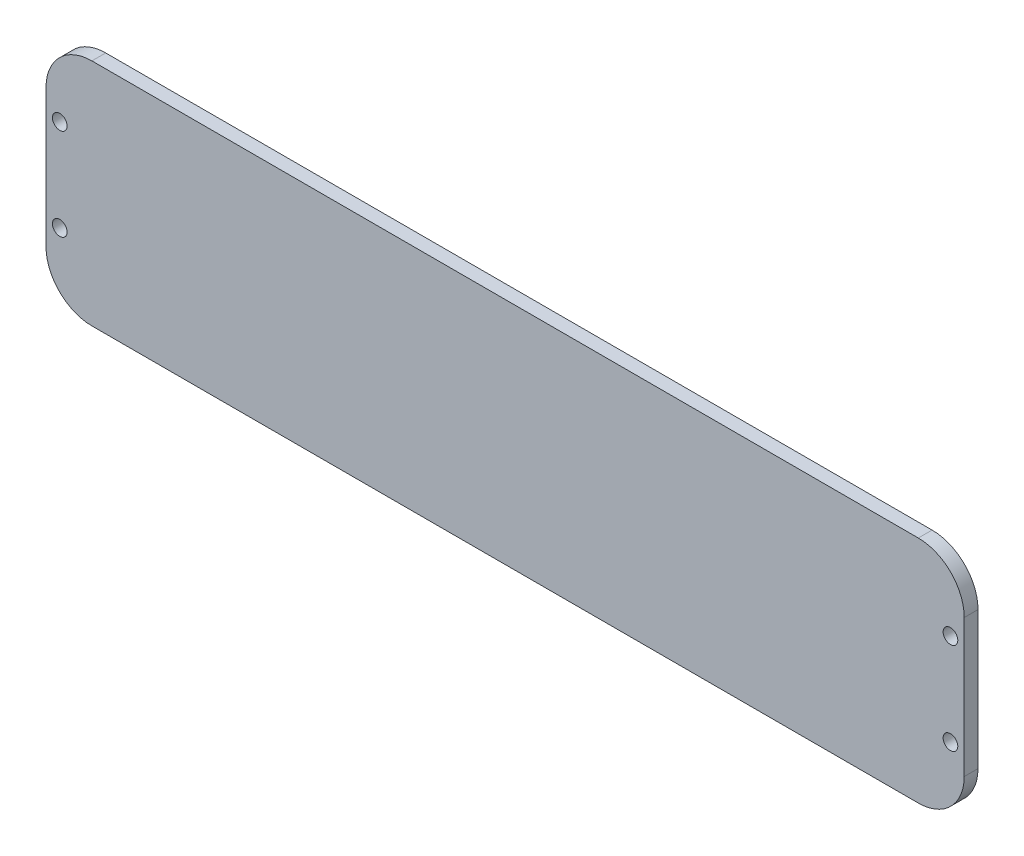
ISO-10303-21;
HEADER;
FILE_DESCRIPTION(('STEP AP214'),'2;1');
FILE_NAME('part.step','',(''),(''),'','','');
FILE_SCHEMA(('AUTOMOTIVE_DESIGN { 1 0 10303 214 1 1 1 1 }'));
ENDSEC;
DATA;
#1=APPLICATION_CONTEXT('core data for automotive mechanical design processes');
#2=APPLICATION_PROTOCOL_DEFINITION('international standard','automotive_design',2000,#1);
#3=PRODUCT_CONTEXT('',#1,'mechanical');
#4=PRODUCT('Part','Part','',(#3));
#5=PRODUCT_RELATED_PRODUCT_CATEGORY('part','',(#4));
#6=PRODUCT_DEFINITION_FORMATION('','',#4);
#7=PRODUCT_DEFINITION_CONTEXT('part definition',#1,'design');
#8=PRODUCT_DEFINITION('design','',#6,#7);
#9=PRODUCT_DEFINITION_SHAPE('','',#8);
#10=(LENGTH_UNIT() NAMED_UNIT(*) SI_UNIT(.MILLI.,.METRE.));
#11=(NAMED_UNIT(*) PLANE_ANGLE_UNIT() SI_UNIT($,.RADIAN.));
#12=(NAMED_UNIT(*) SI_UNIT($,.STERADIAN.) SOLID_ANGLE_UNIT());
#13=UNCERTAINTY_MEASURE_WITH_UNIT(LENGTH_MEASURE(1.E-05),#10,'distance_accuracy_value','');
#14=(GEOMETRIC_REPRESENTATION_CONTEXT(3) GLOBAL_UNCERTAINTY_ASSIGNED_CONTEXT((#13)) GLOBAL_UNIT_ASSIGNED_CONTEXT((#10,
#11,#12)) REPRESENTATION_CONTEXT('',''));
#15=CARTESIAN_POINT('',(0.,0.,0.));
#16=DIRECTION('',(0.,0.,1.));
#17=DIRECTION('',(1.,0.,0.));
#18=AXIS2_PLACEMENT_3D('',#15,#16,#17);
#19=CARTESIAN_POINT('',(0.,0.,3.));
#20=DIRECTION('',(0.,0.,-1.));
#21=DIRECTION('',(-1.,0.,0.));
#22=AXIS2_PLACEMENT_3D('',#19,#20,#21);
#23=PLANE('',#22);
#24=DIRECTION('',(1.,0.,0.));
#25=VECTOR('',#24,1.);
#26=CARTESIAN_POINT('',(-100.,-25.,3.));
#27=LINE('',#26,#25);
#28=CARTESIAN_POINT('',(-90.,-25.,3.));
#29=VERTEX_POINT('',#28);
#30=CARTESIAN_POINT('',(90.,-25.,3.));
#31=VERTEX_POINT('',#30);
#32=EDGE_CURVE('E148',#29,#31,#27,.T.);
#33=ORIENTED_EDGE('',*,*,#32,.T.);
#34=CARTESIAN_POINT('',(90.,-15.,3.));
#35=DIRECTION('',(0.,0.,-1.));
#36=DIRECTION('',(-1.,0.,0.));
#37=AXIS2_PLACEMENT_3D('',#34,#35,#36);
#38=CIRCLE('',#37,10.);
#39=CARTESIAN_POINT('',(100.,-15.,3.));
#40=VERTEX_POINT('',#39);
#41=EDGE_CURVE('E178',#31,#40,#38,.F.);
#42=ORIENTED_EDGE('',*,*,#41,.T.);
#43=DIRECTION('',(0.,1.,0.));
#44=VECTOR('',#43,1.);
#45=CARTESIAN_POINT('',(100.,-25.,3.));
#46=LINE('',#45,#44);
#47=CARTESIAN_POINT('',(100.,15.,3.));
#48=VERTEX_POINT('',#47);
#49=EDGE_CURVE('E126',#40,#48,#46,.T.);
#50=ORIENTED_EDGE('',*,*,#49,.T.);
#51=CARTESIAN_POINT('',(90.,15.,3.));
#52=DIRECTION('',(0.,0.,-1.));
#53=DIRECTION('',(-1.,0.,0.));
#54=AXIS2_PLACEMENT_3D('',#51,#52,#53);
#55=CIRCLE('',#54,10.);
#56=CARTESIAN_POINT('',(90.,25.,3.));
#57=VERTEX_POINT('',#56);
#58=EDGE_CURVE('E170',#48,#57,#55,.F.);
#59=ORIENTED_EDGE('',*,*,#58,.T.);
#60=DIRECTION('',(-1.,0.,0.));
#61=VECTOR('',#60,1.);
#62=CARTESIAN_POINT('',(-100.,25.,3.));
#63=LINE('',#62,#61);
#64=CARTESIAN_POINT('',(-90.,25.,3.));
#65=VERTEX_POINT('',#64);
#66=EDGE_CURVE('E192',#57,#65,#63,.T.);
#67=ORIENTED_EDGE('',*,*,#66,.T.);
#68=CARTESIAN_POINT('',(-90.,15.,3.));
#69=DIRECTION('',(0.,0.,-1.));
#70=DIRECTION('',(-1.,0.,0.));
#71=AXIS2_PLACEMENT_3D('',#68,#69,#70);
#72=CIRCLE('',#71,10.);
#73=CARTESIAN_POINT('',(-100.,15.,3.));
#74=VERTEX_POINT('',#73);
#75=EDGE_CURVE('E61',#65,#74,#72,.F.);
#76=ORIENTED_EDGE('',*,*,#75,.T.);
#77=DIRECTION('',(0.,-1.,0.));
#78=VECTOR('',#77,1.);
#79=CARTESIAN_POINT('',(-100.,-25.,3.));
#80=LINE('',#79,#78);
#81=CARTESIAN_POINT('',(-100.,-15.,3.));
#82=VERTEX_POINT('',#81);
#83=EDGE_CURVE('E200',#74,#82,#80,.T.);
#84=ORIENTED_EDGE('',*,*,#83,.T.);
#85=CARTESIAN_POINT('',(-90.,-15.,3.));
#86=DIRECTION('',(0.,0.,-1.));
#87=DIRECTION('',(-1.,0.,0.));
#88=AXIS2_PLACEMENT_3D('',#85,#86,#87);
#89=CIRCLE('',#88,10.);
#90=EDGE_CURVE('E175',#82,#29,#89,.F.);
#91=ORIENTED_EDGE('',*,*,#90,.T.);
#92=EDGE_LOOP('',(#33,#42,#50,#59,#67,#76,#84,#91));
#93=FACE_BOUND('',#92,.T.);
#94=CARTESIAN_POINT('',(-97.,10.,3.));
#95=DIRECTION('',(0.,0.,1.));
#96=DIRECTION('',(1.,0.,0.));
#97=AXIS2_PLACEMENT_3D('',#94,#95,#96);
#98=CIRCLE('',#97,1.6);
#99=CARTESIAN_POINT('',(-95.4,10.,3.));
#100=VERTEX_POINT('',#99);
#101=EDGE_CURVE('E136',#100,#100,#98,.T.);
#102=ORIENTED_EDGE('',*,*,#101,.F.);
#103=EDGE_LOOP('',(#102));
#104=FACE_BOUND('',#103,.T.);
#105=CARTESIAN_POINT('',(-97.,-10.,3.));
#106=DIRECTION('',(0.,0.,1.));
#107=DIRECTION('',(1.,0.,0.));
#108=AXIS2_PLACEMENT_3D('',#105,#106,#107);
#109=CIRCLE('',#108,1.6);
#110=CARTESIAN_POINT('',(-95.4,-10.,3.));
#111=VERTEX_POINT('',#110);
#112=EDGE_CURVE('E212',#111,#111,#109,.T.);
#113=ORIENTED_EDGE('',*,*,#112,.F.);
#114=EDGE_LOOP('',(#113));
#115=FACE_BOUND('',#114,.T.);
#116=CARTESIAN_POINT('',(97.,-10.,3.));
#117=DIRECTION('',(0.,0.,1.));
#118=DIRECTION('',(-1.,0.,0.));
#119=AXIS2_PLACEMENT_3D('',#116,#117,#118);
#120=CIRCLE('',#119,1.6);
#121=CARTESIAN_POINT('',(95.4,-10.,3.));
#122=VERTEX_POINT('',#121);
#123=EDGE_CURVE('E218',#122,#122,#120,.T.);
#124=ORIENTED_EDGE('',*,*,#123,.F.);
#125=EDGE_LOOP('',(#124));
#126=FACE_BOUND('',#125,.T.);
#127=CARTESIAN_POINT('',(97.,10.,3.));
#128=DIRECTION('',(0.,0.,1.));
#129=DIRECTION('',(-1.,0.,0.));
#130=AXIS2_PLACEMENT_3D('',#127,#128,#129);
#131=CIRCLE('',#130,1.6);
#132=CARTESIAN_POINT('',(95.4,10.,3.));
#133=VERTEX_POINT('',#132);
#134=EDGE_CURVE('E226',#133,#133,#131,.T.);
#135=ORIENTED_EDGE('',*,*,#134,.F.);
#136=EDGE_LOOP('',(#135));
#137=FACE_BOUND('',#136,.T.);
#138=ADVANCED_FACE('F38',(#93,#104,#115,#126,#137),#23,.F.);
#139=CARTESIAN_POINT('',(0.,0.,0.));
#140=DIRECTION('',(0.,0.,-1.));
#141=DIRECTION('',(-1.,0.,0.));
#142=AXIS2_PLACEMENT_3D('',#139,#140,#141);
#143=PLANE('',#142);
#144=CARTESIAN_POINT('',(97.,-10.,0.));
#145=DIRECTION('',(0.,0.,1.));
#146=DIRECTION('',(-1.,0.,0.));
#147=AXIS2_PLACEMENT_3D('',#144,#145,#146);
#148=CIRCLE('',#147,1.6);
#149=CARTESIAN_POINT('',(95.4,-10.,0.));
#150=VERTEX_POINT('',#149);
#151=EDGE_CURVE('E222',#150,#150,#148,.T.);
#152=ORIENTED_EDGE('',*,*,#151,.T.);
#153=EDGE_LOOP('',(#152));
#154=FACE_BOUND('',#153,.T.);
#155=CARTESIAN_POINT('',(-97.,10.,0.));
#156=DIRECTION('',(0.,0.,1.));
#157=DIRECTION('',(1.,0.,0.));
#158=AXIS2_PLACEMENT_3D('',#155,#156,#157);
#159=CIRCLE('',#158,1.6);
#160=CARTESIAN_POINT('',(-95.4,10.,0.));
#161=VERTEX_POINT('',#160);
#162=EDGE_CURVE('E145',#161,#161,#159,.T.);
#163=ORIENTED_EDGE('',*,*,#162,.T.);
#164=EDGE_LOOP('',(#163));
#165=FACE_BOUND('',#164,.T.);
#166=DIRECTION('',(0.,1.,0.));
#167=VECTOR('',#166,1.);
#168=CARTESIAN_POINT('',(100.,-25.,0.));
#169=LINE('',#168,#167);
#170=CARTESIAN_POINT('',(100.,-15.,0.));
#171=VERTEX_POINT('',#170);
#172=CARTESIAN_POINT('',(100.,15.,0.));
#173=VERTEX_POINT('',#172);
#174=EDGE_CURVE('E123',#171,#173,#169,.T.);
#175=ORIENTED_EDGE('',*,*,#174,.F.);
#176=CARTESIAN_POINT('',(90.,-15.,0.));
#177=DIRECTION('',(0.,0.,-1.));
#178=DIRECTION('',(-1.,0.,0.));
#179=AXIS2_PLACEMENT_3D('',#176,#177,#178);
#180=CIRCLE('',#179,10.);
#181=CARTESIAN_POINT('',(90.,-25.,0.));
#182=VERTEX_POINT('',#181);
#183=EDGE_CURVE('E105',#171,#182,#180,.T.);
#184=ORIENTED_EDGE('',*,*,#183,.T.);
#185=DIRECTION('',(1.,0.,0.));
#186=VECTOR('',#185,1.);
#187=CARTESIAN_POINT('',(-100.,-25.,0.));
#188=LINE('',#187,#186);
#189=CARTESIAN_POINT('',(-90.,-25.,0.));
#190=VERTEX_POINT('',#189);
#191=EDGE_CURVE('E153',#190,#182,#188,.T.);
#192=ORIENTED_EDGE('',*,*,#191,.F.);
#193=CARTESIAN_POINT('',(-90.,-15.,0.));
#194=DIRECTION('',(0.,0.,-1.));
#195=DIRECTION('',(-1.,0.,0.));
#196=AXIS2_PLACEMENT_3D('',#193,#194,#195);
#197=CIRCLE('',#196,10.);
#198=CARTESIAN_POINT('',(-100.,-15.,0.));
#199=VERTEX_POINT('',#198);
#200=EDGE_CURVE('E117',#190,#199,#197,.T.);
#201=ORIENTED_EDGE('',*,*,#200,.T.);
#202=DIRECTION('',(0.,-1.,0.));
#203=VECTOR('',#202,1.);
#204=CARTESIAN_POINT('',(-100.,-25.,0.));
#205=LINE('',#204,#203);
#206=CARTESIAN_POINT('',(-100.,15.,0.));
#207=VERTEX_POINT('',#206);
#208=EDGE_CURVE('E141',#207,#199,#205,.T.);
#209=ORIENTED_EDGE('',*,*,#208,.F.);
#210=CARTESIAN_POINT('',(-90.,15.,0.));
#211=DIRECTION('',(0.,0.,-1.));
#212=DIRECTION('',(-1.,0.,0.));
#213=AXIS2_PLACEMENT_3D('',#210,#211,#212);
#214=CIRCLE('',#213,10.);
#215=CARTESIAN_POINT('',(-90.,25.,0.));
#216=VERTEX_POINT('',#215);
#217=EDGE_CURVE('E160',#207,#216,#214,.T.);
#218=ORIENTED_EDGE('',*,*,#217,.T.);
#219=DIRECTION('',(-1.,0.,0.));
#220=VECTOR('',#219,1.);
#221=CARTESIAN_POINT('',(-100.,25.,0.));
#222=LINE('',#221,#220);
#223=CARTESIAN_POINT('',(90.,25.,0.));
#224=VERTEX_POINT('',#223);
#225=EDGE_CURVE('E135',#224,#216,#222,.T.);
#226=ORIENTED_EDGE('',*,*,#225,.F.);
#227=CARTESIAN_POINT('',(90.,15.,0.));
#228=DIRECTION('',(0.,0.,-1.));
#229=DIRECTION('',(-1.,0.,0.));
#230=AXIS2_PLACEMENT_3D('',#227,#228,#229);
#231=CIRCLE('',#230,10.);
#232=EDGE_CURVE('E128',#224,#173,#231,.T.);
#233=ORIENTED_EDGE('',*,*,#232,.T.);
#234=EDGE_LOOP('',(#175,#184,#192,#201,#209,#218,#226,#233));
#235=FACE_BOUND('',#234,.T.);
#236=CARTESIAN_POINT('',(-97.,-10.,0.));
#237=DIRECTION('',(0.,0.,1.));
#238=DIRECTION('',(1.,0.,0.));
#239=AXIS2_PLACEMENT_3D('',#236,#237,#238);
#240=CIRCLE('',#239,1.6);
#241=CARTESIAN_POINT('',(-95.4,-10.,0.));
#242=VERTEX_POINT('',#241);
#243=EDGE_CURVE('E214',#242,#242,#240,.T.);
#244=ORIENTED_EDGE('',*,*,#243,.T.);
#245=EDGE_LOOP('',(#244));
#246=FACE_BOUND('',#245,.T.);
#247=CARTESIAN_POINT('',(97.,10.,0.));
#248=DIRECTION('',(0.,0.,1.));
#249=DIRECTION('',(-1.,0.,0.));
#250=AXIS2_PLACEMENT_3D('',#247,#248,#249);
#251=CIRCLE('',#250,1.6);
#252=CARTESIAN_POINT('',(95.4,10.,0.));
#253=VERTEX_POINT('',#252);
#254=EDGE_CURVE('E230',#253,#253,#251,.T.);
#255=ORIENTED_EDGE('',*,*,#254,.T.);
#256=EDGE_LOOP('',(#255));
#257=FACE_BOUND('',#256,.T.);
#258=ADVANCED_FACE('F131',(#154,#165,#235,#246,#257),#143,.T.);
#259=CARTESIAN_POINT('',(100.,-25.,3.));
#260=DIRECTION('',(-1.,0.,0.));
#261=DIRECTION('',(0.,0.,1.));
#262=AXIS2_PLACEMENT_3D('',#259,#260,#261);
#263=PLANE('',#262);
#264=ORIENTED_EDGE('',*,*,#49,.F.);
#265=DIRECTION('',(0.,0.,-1.));
#266=VECTOR('',#265,1.);
#267=CARTESIAN_POINT('',(100.,-15.,3.));
#268=LINE('',#267,#266);
#269=EDGE_CURVE('E109',#40,#171,#268,.T.);
#270=ORIENTED_EDGE('',*,*,#269,.T.);
#271=ORIENTED_EDGE('',*,*,#174,.T.);
#272=DIRECTION('',(0.,0.,-1.));
#273=VECTOR('',#272,1.);
#274=CARTESIAN_POINT('',(100.,15.,3.));
#275=LINE('',#274,#273);
#276=EDGE_CURVE('E129',#173,#48,#275,.F.);
#277=ORIENTED_EDGE('',*,*,#276,.T.);
#278=EDGE_LOOP('',(#264,#270,#271,#277));
#279=FACE_BOUND('',#278,.T.);
#280=ADVANCED_FACE('F122',(#279),#263,.F.);
#281=CARTESIAN_POINT('',(-100.,25.,3.));
#282=DIRECTION('',(0.,-1.,0.));
#283=DIRECTION('',(0.,0.,-1.));
#284=AXIS2_PLACEMENT_3D('',#281,#282,#283);
#285=PLANE('',#284);
#286=ORIENTED_EDGE('',*,*,#225,.T.);
#287=DIRECTION('',(0.,0.,-1.));
#288=VECTOR('',#287,1.);
#289=CARTESIAN_POINT('',(-90.,25.,3.));
#290=LINE('',#289,#288);
#291=EDGE_CURVE('E11',#216,#65,#290,.F.);
#292=ORIENTED_EDGE('',*,*,#291,.T.);
#293=ORIENTED_EDGE('',*,*,#66,.F.);
#294=DIRECTION('',(0.,0.,-1.));
#295=VECTOR('',#294,1.);
#296=CARTESIAN_POINT('',(90.,25.,3.));
#297=LINE('',#296,#295);
#298=EDGE_CURVE('E47',#57,#224,#297,.T.);
#299=ORIENTED_EDGE('',*,*,#298,.T.);
#300=EDGE_LOOP('',(#286,#292,#293,#299));
#301=FACE_BOUND('',#300,.T.);
#302=ADVANCED_FACE('F190',(#301),#285,.F.);
#303=CARTESIAN_POINT('',(-100.,-25.,3.));
#304=DIRECTION('',(1.,0.,0.));
#305=DIRECTION('',(0.,0.,-1.));
#306=AXIS2_PLACEMENT_3D('',#303,#304,#305);
#307=PLANE('',#306);
#308=ORIENTED_EDGE('',*,*,#208,.T.);
#309=DIRECTION('',(0.,0.,-1.));
#310=VECTOR('',#309,1.);
#311=CARTESIAN_POINT('',(-100.,-15.,3.));
#312=LINE('',#311,#310);
#313=EDGE_CURVE('E54',#199,#82,#312,.F.);
#314=ORIENTED_EDGE('',*,*,#313,.T.);
#315=ORIENTED_EDGE('',*,*,#83,.F.);
#316=DIRECTION('',(0.,0.,-1.));
#317=VECTOR('',#316,1.);
#318=CARTESIAN_POINT('',(-100.,15.,3.));
#319=LINE('',#318,#317);
#320=EDGE_CURVE('E181',#74,#207,#319,.T.);
#321=ORIENTED_EDGE('',*,*,#320,.T.);
#322=EDGE_LOOP('',(#308,#314,#315,#321));
#323=FACE_BOUND('',#322,.T.);
#324=ADVANCED_FACE('F199',(#323),#307,.F.);
#325=CARTESIAN_POINT('',(-100.,-25.,3.));
#326=DIRECTION('',(0.,1.,0.));
#327=DIRECTION('',(0.,0.,1.));
#328=AXIS2_PLACEMENT_3D('',#325,#326,#327);
#329=PLANE('',#328);
#330=ORIENTED_EDGE('',*,*,#191,.T.);
#331=DIRECTION('',(0.,0.,-1.));
#332=VECTOR('',#331,1.);
#333=CARTESIAN_POINT('',(90.,-25.,3.));
#334=LINE('',#333,#332);
#335=EDGE_CURVE('E110',#182,#31,#334,.F.);
#336=ORIENTED_EDGE('',*,*,#335,.T.);
#337=ORIENTED_EDGE('',*,*,#32,.F.);
#338=DIRECTION('',(0.,0.,-1.));
#339=VECTOR('',#338,1.);
#340=CARTESIAN_POINT('',(-90.,-25.,3.));
#341=LINE('',#340,#339);
#342=EDGE_CURVE('E116',#29,#190,#341,.T.);
#343=ORIENTED_EDGE('',*,*,#342,.T.);
#344=EDGE_LOOP('',(#330,#336,#337,#343));
#345=FACE_BOUND('',#344,.T.);
#346=ADVANCED_FACE('F253',(#345),#329,.F.);
#347=CARTESIAN_POINT('',(-97.,10.,3.));
#348=DIRECTION('',(0.,0.,-1.));
#349=DIRECTION('',(-1.,0.,0.));
#350=AXIS2_PLACEMENT_3D('',#347,#348,#349);
#351=CYLINDRICAL_SURFACE('',#350,1.6);
#352=ORIENTED_EDGE('',*,*,#101,.T.);
#353=EDGE_LOOP('',(#352));
#354=FACE_BOUND('',#353,.T.);
#355=ORIENTED_EDGE('',*,*,#162,.F.);
#356=EDGE_LOOP('',(#355));
#357=FACE_BOUND('',#356,.T.);
#358=ADVANCED_FACE('F250',(#354,#357),#351,.F.);
#359=CARTESIAN_POINT('',(-97.,-10.,3.));
#360=DIRECTION('',(0.,0.,-1.));
#361=DIRECTION('',(-1.,0.,0.));
#362=AXIS2_PLACEMENT_3D('',#359,#360,#361);
#363=CYLINDRICAL_SURFACE('',#362,1.6);
#364=ORIENTED_EDGE('',*,*,#112,.T.);
#365=EDGE_LOOP('',(#364));
#366=FACE_BOUND('',#365,.T.);
#367=ORIENTED_EDGE('',*,*,#243,.F.);
#368=EDGE_LOOP('',(#367));
#369=FACE_BOUND('',#368,.T.);
#370=ADVANCED_FACE('F306',(#366,#369),#363,.F.);
#371=CARTESIAN_POINT('',(97.,-10.,3.));
#372=DIRECTION('',(0.,0.,-1.));
#373=DIRECTION('',(-1.,0.,0.));
#374=AXIS2_PLACEMENT_3D('',#371,#372,#373);
#375=CYLINDRICAL_SURFACE('',#374,1.6);
#376=ORIENTED_EDGE('',*,*,#123,.T.);
#377=EDGE_LOOP('',(#376));
#378=FACE_BOUND('',#377,.T.);
#379=ORIENTED_EDGE('',*,*,#151,.F.);
#380=EDGE_LOOP('',(#379));
#381=FACE_BOUND('',#380,.T.);
#382=ADVANCED_FACE('F297',(#378,#381),#375,.F.);
#383=CARTESIAN_POINT('',(97.,10.,3.));
#384=DIRECTION('',(0.,0.,-1.));
#385=DIRECTION('',(-1.,0.,0.));
#386=AXIS2_PLACEMENT_3D('',#383,#384,#385);
#387=CYLINDRICAL_SURFACE('',#386,1.6);
#388=ORIENTED_EDGE('',*,*,#134,.T.);
#389=EDGE_LOOP('',(#388));
#390=FACE_BOUND('',#389,.T.);
#391=ORIENTED_EDGE('',*,*,#254,.F.);
#392=EDGE_LOOP('',(#391));
#393=FACE_BOUND('',#392,.T.);
#394=ADVANCED_FACE('F238',(#390,#393),#387,.F.);
#395=CARTESIAN_POINT('',(90.,-15.,3.));
#396=DIRECTION('',(0.,0.,-1.));
#397=DIRECTION('',(-1.,0.,0.));
#398=AXIS2_PLACEMENT_3D('',#395,#396,#397);
#399=CYLINDRICAL_SURFACE('',#398,10.);
#400=ORIENTED_EDGE('',*,*,#41,.F.);
#401=ORIENTED_EDGE('',*,*,#335,.F.);
#402=ORIENTED_EDGE('',*,*,#183,.F.);
#403=ORIENTED_EDGE('',*,*,#269,.F.);
#404=EDGE_LOOP('',(#400,#401,#402,#403));
#405=FACE_BOUND('',#404,.T.);
#406=ADVANCED_FACE('F108',(#405),#399,.T.);
#407=CARTESIAN_POINT('',(-90.,-15.,3.));
#408=DIRECTION('',(0.,0.,-1.));
#409=DIRECTION('',(-1.,0.,0.));
#410=AXIS2_PLACEMENT_3D('',#407,#408,#409);
#411=CYLINDRICAL_SURFACE('',#410,10.);
#412=ORIENTED_EDGE('',*,*,#90,.F.);
#413=ORIENTED_EDGE('',*,*,#313,.F.);
#414=ORIENTED_EDGE('',*,*,#200,.F.);
#415=ORIENTED_EDGE('',*,*,#342,.F.);
#416=EDGE_LOOP('',(#412,#413,#414,#415));
#417=FACE_BOUND('',#416,.T.);
#418=ADVANCED_FACE('F265',(#417),#411,.T.);
#419=CARTESIAN_POINT('',(-90.,15.,3.));
#420=DIRECTION('',(0.,0.,-1.));
#421=DIRECTION('',(-1.,0.,0.));
#422=AXIS2_PLACEMENT_3D('',#419,#420,#421);
#423=CYLINDRICAL_SURFACE('',#422,10.);
#424=ORIENTED_EDGE('',*,*,#75,.F.);
#425=ORIENTED_EDGE('',*,*,#291,.F.);
#426=ORIENTED_EDGE('',*,*,#217,.F.);
#427=ORIENTED_EDGE('',*,*,#320,.F.);
#428=EDGE_LOOP('',(#424,#425,#426,#427));
#429=FACE_BOUND('',#428,.T.);
#430=ADVANCED_FACE('F198',(#429),#423,.T.);
#431=CARTESIAN_POINT('',(90.,15.,3.));
#432=DIRECTION('',(0.,0.,-1.));
#433=DIRECTION('',(-1.,0.,0.));
#434=AXIS2_PLACEMENT_3D('',#431,#432,#433);
#435=CYLINDRICAL_SURFACE('',#434,10.);
#436=ORIENTED_EDGE('',*,*,#58,.F.);
#437=ORIENTED_EDGE('',*,*,#276,.F.);
#438=ORIENTED_EDGE('',*,*,#232,.F.);
#439=ORIENTED_EDGE('',*,*,#298,.F.);
#440=EDGE_LOOP('',(#436,#437,#438,#439));
#441=FACE_BOUND('',#440,.T.);
#442=ADVANCED_FACE('F40',(#441),#435,.T.);
#443=CLOSED_SHELL('',(#138,#258,#280,#302,#324,#346,#358,#370,#382,#394,#406,#418,#430,#442));
#444=MANIFOLD_SOLID_BREP('B2',#443);
#445=ADVANCED_BREP_SHAPE_REPRESENTATION('',(#18,#444),#14);
#446=SHAPE_DEFINITION_REPRESENTATION(#9,#445);
ENDSEC;
END-ISO-10303-21;
